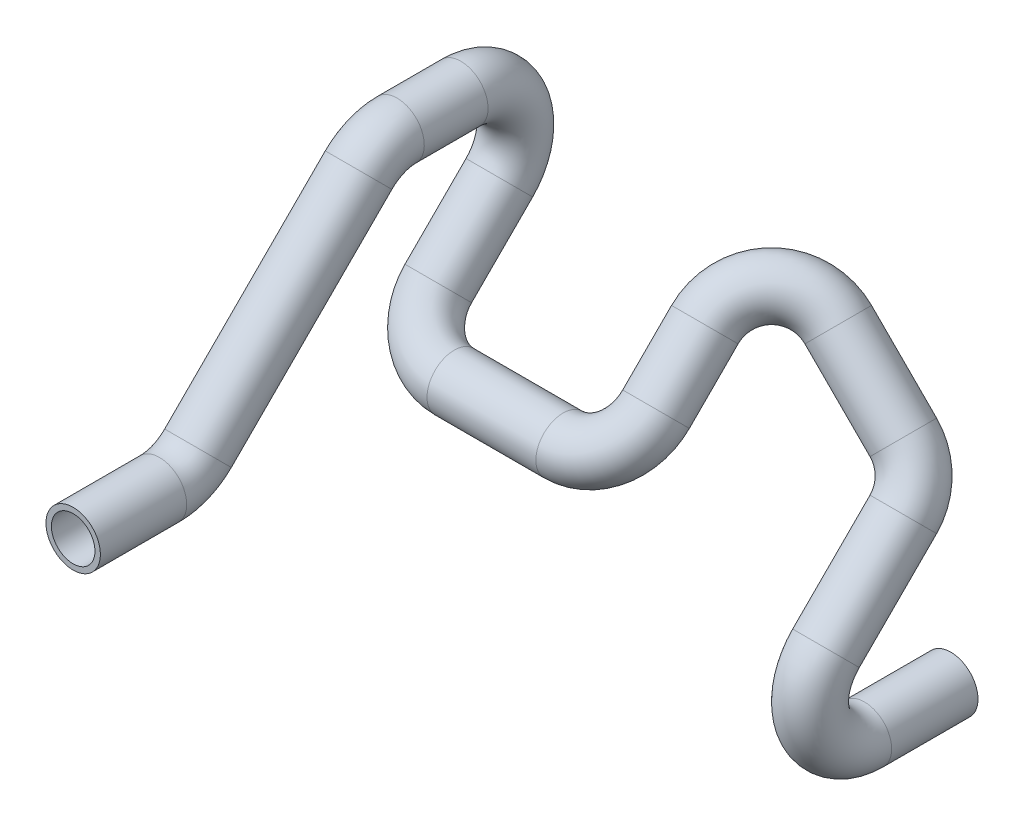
from build123d import *

# Parameters (mm, degrees)
SKETCH2_R   = 6.35
SKETCH2_R_2 = 5.08


with BuildPart() as part:
    # Sweep1: sweep along a curve in space
    with BuildLine() as sweep1_path:
        Line((-101.6, 0, 5.260512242), (-101.6, 0, 25.4))
        ThreePointArc((-101.6, 0, 5.260512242), (-101.6, 0.966729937, 0.400432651), (-101.6, 3.719743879, -3.719743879))
        Line((-101.6, 3.719743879, -3.719743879), (-101.6, 41.181536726, -41.181536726))
        ThreePointArc((-101.6, 41.181536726, -41.181536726), (-101.6, 43.934550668, -45.301713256), (-101.6, 44.901280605, -50.161792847))
        Line((-101.6, 44.901280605, -50.161792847), (-101.6, 44.901280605, -65.040768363))
        ThreePointArc((-101.6, 44.901280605, -65.040768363), (-101.6, 37.061360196, -76.774038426), (-101.6, 23.221024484, -74.021024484))
        Line((-101.6, 23.221024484, -74.021024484), (-101.6, 8.980256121, -59.780256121))
        ThreePointArc((-101.6, 8.980256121, -59.780256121), (-97.880256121, 2.630256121, -53.430256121), (-88.9, 0, -50.8))
        Line((-88.9, 0, -50.8), (-63.5, 0, -50.8))
        ThreePointArc((-63.5, 0, -50.8), (-54.519743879, 2.630256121, -53.430256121), (-50.8, 8.980256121, -59.780256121))
        Line((-50.8, 8.980256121, -59.780256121), (-50.8, 20.366764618, -71.166764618))
        ThreePointArc((-50.8, 20.366764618, -71.166764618), (-45.615246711, 25.551517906, -81.536271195), (-35.245740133, 20.366764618, -86.721024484))
        Line((-35.245740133, 20.366764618, -86.721024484), (-20.063728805, 5.184753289, -86.721024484))
        ThreePointArc((-20.063728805, 5.184753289, -86.721024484), (-16.268225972, 0, -85.331774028), (-14.878975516, -5.184753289, -81.536271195))
        Line((-14.878975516, -5.184753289, -81.536271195), (-14.878975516, -23.221024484, -63.5))
        ThreePointArc((-14.878975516, -23.221024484, -63.5), (-14.878975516, -37.061360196, -60.746986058), (-14.878975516, -44.901280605, -72.480256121))
        Line((-14.878975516, -44.901280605, -72.480256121), (-14.878975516, -44.901280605, -92.619743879))
    # Sketch2 → Sweep1 (sweep)
    with BuildSketch(Plane(origin=(-101.6, 0, 25.4), x_dir=(1, 0, 0), z_dir=(0, 0, 1))):
        Circle(SKETCH2_R)
        Circle(SKETCH2_R_2, mode=Mode.SUBTRACT)
    sweep(path=sweep1_path.line)


solid = part.part
